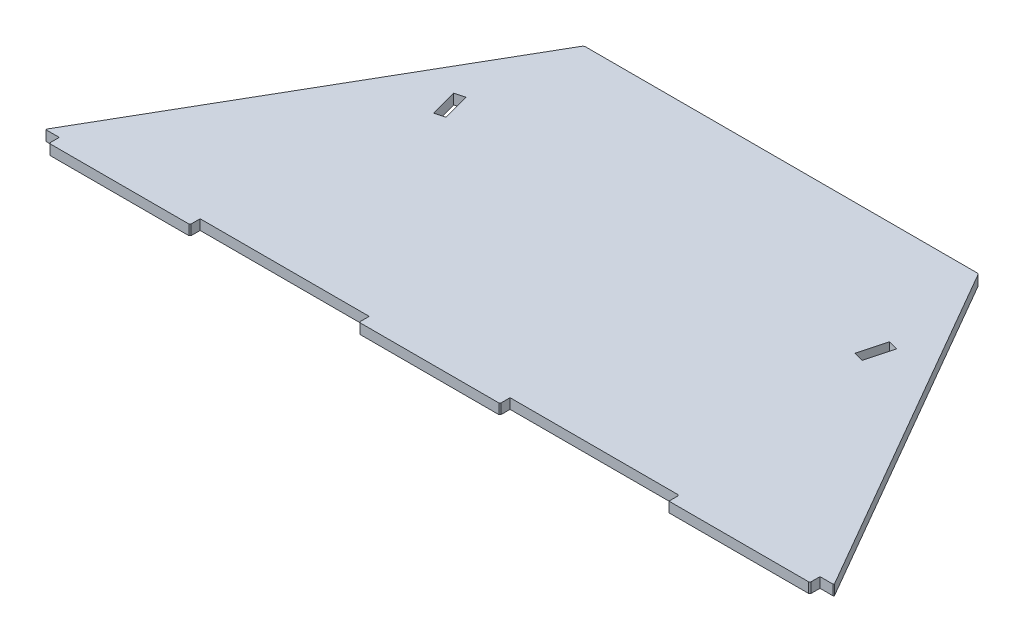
ISO-10303-21;
HEADER;
FILE_DESCRIPTION(('STEP AP214'),'2;1');
FILE_NAME('part.step','',(''),(''),'','','');
FILE_SCHEMA(('AUTOMOTIVE_DESIGN { 1 0 10303 214 1 1 1 1 }'));
ENDSEC;
DATA;
#1=APPLICATION_CONTEXT('core data for automotive mechanical design processes');
#2=APPLICATION_PROTOCOL_DEFINITION('international standard','automotive_design',2000,#1);
#3=PRODUCT_CONTEXT('',#1,'mechanical');
#4=PRODUCT('Part','Part','',(#3));
#5=PRODUCT_RELATED_PRODUCT_CATEGORY('part','',(#4));
#6=PRODUCT_DEFINITION_FORMATION('','',#4);
#7=PRODUCT_DEFINITION_CONTEXT('part definition',#1,'design');
#8=PRODUCT_DEFINITION('design','',#6,#7);
#9=PRODUCT_DEFINITION_SHAPE('','',#8);
#10=(LENGTH_UNIT() NAMED_UNIT(*) SI_UNIT(.MILLI.,.METRE.));
#11=(NAMED_UNIT(*) PLANE_ANGLE_UNIT() SI_UNIT($,.RADIAN.));
#12=(NAMED_UNIT(*) SI_UNIT($,.STERADIAN.) SOLID_ANGLE_UNIT());
#13=UNCERTAINTY_MEASURE_WITH_UNIT(LENGTH_MEASURE(1.E-05),#10,'distance_accuracy_value','');
#14=(GEOMETRIC_REPRESENTATION_CONTEXT(3) GLOBAL_UNCERTAINTY_ASSIGNED_CONTEXT((#13)) GLOBAL_UNIT_ASSIGNED_CONTEXT((#10,
#11,#12)) REPRESENTATION_CONTEXT('',''));
#15=CARTESIAN_POINT('',(0.,0.,0.));
#16=DIRECTION('',(0.,0.,1.));
#17=DIRECTION('',(1.,0.,0.));
#18=AXIS2_PLACEMENT_3D('',#15,#16,#17);
#19=CARTESIAN_POINT('',(-700.,0.,0.));
#20=DIRECTION('',(0.,0.,-1.));
#21=DIRECTION('',(-1.,0.,0.));
#22=AXIS2_PLACEMENT_3D('',#19,#20,#21);
#23=PLANE('',#22);
#24=DIRECTION('',(-1.,0.,0.));
#25=VECTOR('',#24,1.);
#26=CARTESIAN_POINT('',(-700.,0.,0.));
#27=LINE('',#26,#25);
#28=CARTESIAN_POINT('',(423.,0.,0.));
#29=VERTEX_POINT('',#28);
#30=CARTESIAN_POINT('',(125.,0.,0.));
#31=VERTEX_POINT('',#30);
#32=EDGE_CURVE('E395',#29,#31,#27,.T.);
#33=ORIENTED_EDGE('',*,*,#32,.F.);
#34=DIRECTION('',(0.,1.,0.));
#35=VECTOR('',#34,1.);
#36=CARTESIAN_POINT('',(423.,0.,0.));
#37=LINE('',#36,#35);
#38=CARTESIAN_POINT('',(423.,18.,0.));
#39=VERTEX_POINT('',#38);
#40=EDGE_CURVE('E477',#29,#39,#37,.T.);
#41=ORIENTED_EDGE('',*,*,#40,.T.);
#42=DIRECTION('',(-1.,0.,0.));
#43=VECTOR('',#42,1.);
#44=CARTESIAN_POINT('',(-700.,18.,0.));
#45=LINE('',#44,#43);
#46=CARTESIAN_POINT('',(125.,18.,0.));
#47=VERTEX_POINT('',#46);
#48=EDGE_CURVE('E401',#39,#47,#45,.T.);
#49=ORIENTED_EDGE('',*,*,#48,.T.);
#50=DIRECTION('',(0.,1.,0.));
#51=VECTOR('',#50,1.);
#52=CARTESIAN_POINT('',(125.,0.,0.));
#53=LINE('',#52,#51);
#54=EDGE_CURVE('E359',#31,#47,#53,.T.);
#55=ORIENTED_EDGE('',*,*,#54,.F.);
#56=EDGE_LOOP('',(#33,#41,#49,#55));
#57=FACE_BOUND('',#56,.T.);
#58=ADVANCED_FACE('F35',(#57),#23,.F.);
#59=CARTESIAN_POINT('',(-125.,0.,0.));
#60=VERTEX_POINT('',#59);
#61=CARTESIAN_POINT('',(-425.,0.,0.));
#62=VERTEX_POINT('',#61);
#63=EDGE_CURVE('E399',#60,#62,#27,.T.);
#64=ORIENTED_EDGE('',*,*,#63,.F.);
#65=DIRECTION('',(0.,1.,0.));
#66=VECTOR('',#65,1.);
#67=CARTESIAN_POINT('',(-125.,0.,0.));
#68=LINE('',#67,#66);
#69=CARTESIAN_POINT('',(-125.,18.,0.));
#70=VERTEX_POINT('',#69);
#71=EDGE_CURVE('E367',#60,#70,#68,.T.);
#72=ORIENTED_EDGE('',*,*,#71,.T.);
#73=CARTESIAN_POINT('',(-425.,18.,0.));
#74=VERTEX_POINT('',#73);
#75=EDGE_CURVE('E404',#70,#74,#45,.T.);
#76=ORIENTED_EDGE('',*,*,#75,.T.);
#77=DIRECTION('',(0.,1.,0.));
#78=VECTOR('',#77,1.);
#79=CARTESIAN_POINT('',(-425.,0.,0.));
#80=LINE('',#79,#78);
#81=EDGE_CURVE('E382',#62,#74,#80,.T.);
#82=ORIENTED_EDGE('',*,*,#81,.F.);
#83=EDGE_LOOP('',(#64,#72,#76,#82));
#84=FACE_BOUND('',#83,.T.);
#85=ADVANCED_FACE('F555',(#84),#23,.F.);
#86=CARTESIAN_POINT('',(698.,0.,0.));
#87=VERTEX_POINT('',#86);
#88=CARTESIAN_POINT('',(675.,0.,0.));
#89=VERTEX_POINT('',#88);
#90=EDGE_CURVE('E398',#87,#89,#27,.T.);
#91=ORIENTED_EDGE('',*,*,#90,.F.);
#92=DIRECTION('',(0.,1.,0.));
#93=VECTOR('',#92,1.);
#94=CARTESIAN_POINT('',(698.,0.,0.));
#95=LINE('',#94,#93);
#96=CARTESIAN_POINT('',(698.,18.,0.));
#97=VERTEX_POINT('',#96);
#98=EDGE_CURVE('E458',#87,#97,#95,.T.);
#99=ORIENTED_EDGE('',*,*,#98,.T.);
#100=CARTESIAN_POINT('',(675.,18.,0.));
#101=VERTEX_POINT('',#100);
#102=EDGE_CURVE('E403',#97,#101,#45,.T.);
#103=ORIENTED_EDGE('',*,*,#102,.T.);
#104=DIRECTION('',(0.,1.,0.));
#105=VECTOR('',#104,1.);
#106=CARTESIAN_POINT('',(675.,0.,0.));
#107=LINE('',#106,#105);
#108=EDGE_CURVE('E344',#89,#101,#107,.T.);
#109=ORIENTED_EDGE('',*,*,#108,.F.);
#110=EDGE_LOOP('',(#91,#99,#103,#109));
#111=FACE_BOUND('',#110,.T.);
#112=ADVANCED_FACE('F605',(#111),#23,.F.);
#113=CARTESIAN_POINT('',(700.,18.,0.));
#114=DIRECTION('',(-0.866025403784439,0.,0.5));
#115=DIRECTION('',(0.5,0.,0.866025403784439));
#116=AXIS2_PLACEMENT_3D('',#113,#114,#115);
#117=PLANE('',#116);
#118=DIRECTION('',(-0.5,0.,-0.866025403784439));
#119=VECTOR('',#118,1.);
#120=CARTESIAN_POINT('',(700.,18.,0.));
#121=LINE('',#120,#119);
#122=CARTESIAN_POINT('',(699.267949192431,18.,-1.26794919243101));
#123=VERTEX_POINT('',#122);
#124=CARTESIAN_POINT('',(351.443375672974,18.,-603.717782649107));
#125=VERTEX_POINT('',#124);
#126=EDGE_CURVE('E405',#123,#125,#121,.T.);
#127=ORIENTED_EDGE('',*,*,#126,.F.);
#128=DIRECTION('',(0.,-1.,0.));
#129=VECTOR('',#128,1.);
#130=CARTESIAN_POINT('',(699.267949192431,18.,-1.26794919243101));
#131=LINE('',#130,#129);
#132=CARTESIAN_POINT('',(699.267949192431,0.,-1.26794919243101));
#133=VERTEX_POINT('',#132);
#134=EDGE_CURVE('E441',#123,#133,#131,.T.);
#135=ORIENTED_EDGE('',*,*,#134,.T.);
#136=DIRECTION('',(-0.5,0.,-0.866025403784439));
#137=VECTOR('',#136,1.);
#138=CARTESIAN_POINT('',(700.,0.,0.));
#139=LINE('',#138,#137);
#140=CARTESIAN_POINT('',(351.443375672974,0.,-603.717782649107));
#141=VERTEX_POINT('',#140);
#142=EDGE_CURVE('E415',#133,#141,#139,.T.);
#143=ORIENTED_EDGE('',*,*,#142,.T.);
#144=DIRECTION('',(0.,-1.,0.));
#145=VECTOR('',#144,1.);
#146=CARTESIAN_POINT('',(351.443375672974,18.,-603.717782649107));
#147=LINE('',#146,#145);
#148=EDGE_CURVE('E431',#141,#125,#147,.F.);
#149=ORIENTED_EDGE('',*,*,#148,.T.);
#150=EDGE_LOOP('',(#127,#135,#143,#149));
#151=FACE_BOUND('',#150,.T.);
#152=ADVANCED_FACE('F616',(#151),#117,.F.);
#153=CARTESIAN_POINT('',(350.,18.,-606.217782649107));
#154=DIRECTION('',(0.,0.,1.));
#155=DIRECTION('',(1.,0.,0.));
#156=AXIS2_PLACEMENT_3D('',#153,#154,#155);
#157=PLANE('',#156);
#158=DIRECTION('',(-1.,0.,0.));
#159=VECTOR('',#158,1.);
#160=CARTESIAN_POINT('',(350.,18.,-606.217782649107));
#161=LINE('',#160,#159);
#162=CARTESIAN_POINT('',(347.113248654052,18.,-606.217782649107));
#163=VERTEX_POINT('',#162);
#164=CARTESIAN_POINT('',(-347.113248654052,18.,-606.217782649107));
#165=VERTEX_POINT('',#164);
#166=EDGE_CURVE('E407',#163,#165,#161,.T.);
#167=ORIENTED_EDGE('',*,*,#166,.F.);
#168=DIRECTION('',(0.,-1.,0.));
#169=VECTOR('',#168,1.);
#170=CARTESIAN_POINT('',(347.113248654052,18.,-606.217782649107));
#171=LINE('',#170,#169);
#172=CARTESIAN_POINT('',(347.113248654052,0.,-606.217782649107));
#173=VERTEX_POINT('',#172);
#174=EDGE_CURVE('E423',#163,#173,#171,.T.);
#175=ORIENTED_EDGE('',*,*,#174,.T.);
#176=DIRECTION('',(-1.,0.,0.));
#177=VECTOR('',#176,1.);
#178=CARTESIAN_POINT('',(350.,0.,-606.217782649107));
#179=LINE('',#178,#177);
#180=CARTESIAN_POINT('',(-347.113248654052,0.,-606.217782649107));
#181=VERTEX_POINT('',#180);
#182=EDGE_CURVE('E417',#173,#181,#179,.T.);
#183=ORIENTED_EDGE('',*,*,#182,.T.);
#184=DIRECTION('',(0.,-1.,0.));
#185=VECTOR('',#184,1.);
#186=CARTESIAN_POINT('',(-347.113248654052,18.,-606.217782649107));
#187=LINE('',#186,#185);
#188=EDGE_CURVE('E414',#181,#165,#187,.F.);
#189=ORIENTED_EDGE('',*,*,#188,.T.);
#190=EDGE_LOOP('',(#167,#175,#183,#189));
#191=FACE_BOUND('',#190,.T.);
#192=ADVANCED_FACE('F620',(#191),#157,.F.);
#193=CARTESIAN_POINT('',(-350.,18.,-606.217782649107));
#194=DIRECTION('',(0.866025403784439,0.,0.5));
#195=DIRECTION('',(0.5,0.,-0.866025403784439));
#196=AXIS2_PLACEMENT_3D('',#193,#194,#195);
#197=PLANE('',#196);
#198=DIRECTION('',(-0.5,0.,0.866025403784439));
#199=VECTOR('',#198,1.);
#200=CARTESIAN_POINT('',(-350.,0.,-606.217782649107));
#201=LINE('',#200,#199);
#202=CARTESIAN_POINT('',(-351.443375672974,0.,-603.717782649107));
#203=VERTEX_POINT('',#202);
#204=CARTESIAN_POINT('',(-699.,0.,-1.732050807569));
#205=VERTEX_POINT('',#204);
#206=EDGE_CURVE('E408',#203,#205,#201,.T.);
#207=ORIENTED_EDGE('',*,*,#206,.T.);
#208=DIRECTION('',(0.,1.,0.));
#209=VECTOR('',#208,1.);
#210=CARTESIAN_POINT('',(-699.,18.,-1.732050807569));
#211=LINE('',#210,#209);
#212=CARTESIAN_POINT('',(-699.,18.,-1.732050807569));
#213=VERTEX_POINT('',#212);
#214=EDGE_CURVE('E495',#205,#213,#211,.T.);
#215=ORIENTED_EDGE('',*,*,#214,.T.);
#216=DIRECTION('',(-0.5,0.,0.866025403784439));
#217=VECTOR('',#216,1.);
#218=CARTESIAN_POINT('',(-350.,18.,-606.217782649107));
#219=LINE('',#218,#217);
#220=CARTESIAN_POINT('',(-351.443375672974,18.,-603.717782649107));
#221=VERTEX_POINT('',#220);
#222=EDGE_CURVE('E411',#221,#213,#219,.T.);
#223=ORIENTED_EDGE('',*,*,#222,.F.);
#224=DIRECTION('',(0.,-1.,0.));
#225=VECTOR('',#224,1.);
#226=CARTESIAN_POINT('',(-351.443375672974,18.,-603.717782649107));
#227=LINE('',#226,#225);
#228=EDGE_CURVE('E438',#221,#203,#227,.T.);
#229=ORIENTED_EDGE('',*,*,#228,.T.);
#230=EDGE_LOOP('',(#207,#215,#223,#229));
#231=FACE_BOUND('',#230,.T.);
#232=ADVANCED_FACE('F589',(#231),#197,.F.);
#233=CARTESIAN_POINT('',(0.,18.,0.));
#234=DIRECTION('',(0.,1.,0.));
#235=DIRECTION('',(0.,0.,1.));
#236=AXIS2_PLACEMENT_3D('',#233,#234,#235);
#237=PLANE('',#236);
#238=DIRECTION('',(0.258819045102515,0.,0.96592582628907));
#239=VECTOR('',#238,1.);
#240=CARTESIAN_POINT('',(-362.663007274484,18.,-374.229430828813));
#241=LINE('',#240,#239);
#242=CARTESIAN_POINT('',(-375.60395952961,18.,-422.525722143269));
#243=VERTEX_POINT('',#242);
#244=CARTESIAN_POINT('',(-362.663007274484,18.,-374.229430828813));
#245=VERTEX_POINT('',#244);
#246=EDGE_CURVE('E259',#243,#245,#241,.T.);
#247=ORIENTED_EDGE('',*,*,#246,.T.);
#248=DIRECTION('',(-0.965925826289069,0.,0.258819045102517));
#249=VECTOR('',#248,1.);
#250=CARTESIAN_POINT('',(-380.049672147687,18.,-369.570688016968));
#251=LINE('',#250,#249);
#252=CARTESIAN_POINT('',(-380.049672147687,18.,-369.570688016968));
#253=VERTEX_POINT('',#252);
#254=EDGE_CURVE('E271',#245,#253,#251,.T.);
#255=ORIENTED_EDGE('',*,*,#254,.T.);
#256=DIRECTION('',(-0.258819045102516,0.,-0.96592582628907));
#257=VECTOR('',#256,1.);
#258=CARTESIAN_POINT('',(-392.990624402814,18.,-417.866979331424));
#259=LINE('',#258,#257);
#260=CARTESIAN_POINT('',(-392.990624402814,18.,-417.866979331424));
#261=VERTEX_POINT('',#260);
#262=EDGE_CURVE('E275',#253,#261,#259,.T.);
#263=ORIENTED_EDGE('',*,*,#262,.T.);
#264=DIRECTION('',(0.96592582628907,0.,-0.258819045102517));
#265=VECTOR('',#264,1.);
#266=CARTESIAN_POINT('',(-375.60395952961,18.,-422.525722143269));
#267=LINE('',#266,#265);
#268=EDGE_CURVE('E267',#261,#243,#267,.T.);
#269=ORIENTED_EDGE('',*,*,#268,.T.);
#270=EDGE_LOOP('',(#247,#255,#263,#269));
#271=FACE_BOUND('',#270,.T.);
#272=DIRECTION('',(-0.965925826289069,0.,-0.258819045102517));
#273=VECTOR('',#272,1.);
#274=CARTESIAN_POINT('',(380.049672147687,18.,-369.570688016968));
#275=LINE('',#274,#273);
#276=CARTESIAN_POINT('',(380.049672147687,18.,-369.570688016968));
#277=VERTEX_POINT('',#276);
#278=CARTESIAN_POINT('',(362.663007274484,18.,-374.229430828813));
#279=VERTEX_POINT('',#278);
#280=EDGE_CURVE('E300',#277,#279,#275,.T.);
#281=ORIENTED_EDGE('',*,*,#280,.T.);
#282=DIRECTION('',(0.258819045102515,0.,-0.96592582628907));
#283=VECTOR('',#282,1.);
#284=CARTESIAN_POINT('',(362.663007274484,18.,-374.229430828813));
#285=LINE('',#284,#283);
#286=CARTESIAN_POINT('',(375.603959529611,18.,-422.525722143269));
#287=VERTEX_POINT('',#286);
#288=EDGE_CURVE('E303',#279,#287,#285,.T.);
#289=ORIENTED_EDGE('',*,*,#288,.T.);
#290=DIRECTION('',(0.96592582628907,0.,0.258819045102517));
#291=VECTOR('',#290,1.);
#292=CARTESIAN_POINT('',(375.603959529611,18.,-422.525722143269));
#293=LINE('',#292,#291);
#294=CARTESIAN_POINT('',(392.990624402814,18.,-417.866979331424));
#295=VERTEX_POINT('',#294);
#296=EDGE_CURVE('E307',#287,#295,#293,.T.);
#297=ORIENTED_EDGE('',*,*,#296,.T.);
#298=DIRECTION('',(-0.258819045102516,0.,0.96592582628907));
#299=VECTOR('',#298,1.);
#300=CARTESIAN_POINT('',(392.990624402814,18.,-417.866979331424));
#301=LINE('',#300,#299);
#302=EDGE_CURVE('E310',#295,#277,#301,.T.);
#303=ORIENTED_EDGE('',*,*,#302,.T.);
#304=EDGE_LOOP('',(#281,#289,#297,#303));
#305=FACE_BOUND('',#304,.T.);
#306=ORIENTED_EDGE('',*,*,#102,.F.);
#307=DIRECTION('',(-0.707106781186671,0.,0.707106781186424));
#308=VECTOR('',#307,1.);
#309=CARTESIAN_POINT('',(348.999999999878,18.,349.));
#310=LINE('',#309,#308);
#311=EDGE_CURVE('E471',#97,#123,#310,.F.);
#312=ORIENTED_EDGE('',*,*,#311,.T.);
#313=ORIENTED_EDGE('',*,*,#126,.T.);
#314=CARTESIAN_POINT('',(347.113248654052,18.,-601.217782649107));
#315=DIRECTION('',(0.,1.,0.));
#316=DIRECTION('',(0.,0.,1.));
#317=AXIS2_PLACEMENT_3D('',#314,#315,#316);
#318=CIRCLE('',#317,5.);
#319=EDGE_CURVE('E436',#125,#163,#318,.T.);
#320=ORIENTED_EDGE('',*,*,#319,.T.);
#321=ORIENTED_EDGE('',*,*,#166,.T.);
#322=CARTESIAN_POINT('',(-347.113248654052,18.,-601.217782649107));
#323=DIRECTION('',(0.,1.,0.));
#324=DIRECTION('',(0.,0.,1.));
#325=AXIS2_PLACEMENT_3D('',#322,#323,#324);
#326=CIRCLE('',#325,5.);
#327=EDGE_CURVE('E434',#165,#221,#326,.T.);
#328=ORIENTED_EDGE('',*,*,#327,.T.);
#329=ORIENTED_EDGE('',*,*,#222,.T.);
#330=DIRECTION('',(-0.258819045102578,0.,-0.965925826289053));
#331=VECTOR('',#330,1.);
#332=CARTESIAN_POINT('',(-651.742865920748,18.,174.633974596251));
#333=LINE('',#332,#331);
#334=CARTESIAN_POINT('',(-698.535898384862,18.,0.));
#335=VERTEX_POINT('',#334);
#336=EDGE_CURVE('E464',#213,#335,#333,.F.);
#337=ORIENTED_EDGE('',*,*,#336,.T.);
#338=CARTESIAN_POINT('',(-675.,18.,0.));
#339=VERTEX_POINT('',#338);
#340=EDGE_CURVE('E392',#339,#335,#45,.T.);
#341=ORIENTED_EDGE('',*,*,#340,.F.);
#342=DIRECTION('',(0.,0.,1.));
#343=VECTOR('',#342,1.);
#344=CARTESIAN_POINT('',(-675.,18.,0.));
#345=LINE('',#344,#343);
#346=CARTESIAN_POINT('',(-675.,18.,16.0000000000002));
#347=VERTEX_POINT('',#346);
#348=EDGE_CURVE('E370',#339,#347,#345,.T.);
#349=ORIENTED_EDGE('',*,*,#348,.T.);
#350=DIRECTION('',(-0.707106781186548,0.,-0.707106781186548));
#351=VECTOR('',#350,1.);
#352=CARTESIAN_POINT('',(-345.5,18.,345.5));
#353=LINE('',#352,#351);
#354=CARTESIAN_POINT('',(-673.,18.,18.0000000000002));
#355=VERTEX_POINT('',#354);
#356=EDGE_CURVE('E460',#347,#355,#353,.F.);
#357=ORIENTED_EDGE('',*,*,#356,.T.);
#358=DIRECTION('',(1.,0.,0.));
#359=VECTOR('',#358,1.);
#360=CARTESIAN_POINT('',(-675.,18.,18.0000000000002));
#361=LINE('',#360,#359);
#362=CARTESIAN_POINT('',(-427.,18.,18.0000000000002));
#363=VERTEX_POINT('',#362);
#364=EDGE_CURVE('E385',#355,#363,#361,.T.);
#365=ORIENTED_EDGE('',*,*,#364,.T.);
#366=DIRECTION('',(-0.707106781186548,0.,0.707106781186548));
#367=VECTOR('',#366,1.);
#368=CARTESIAN_POINT('',(-204.5,18.,-204.5));
#369=LINE('',#368,#367);
#370=CARTESIAN_POINT('',(-425.,18.,16.0000000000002));
#371=VERTEX_POINT('',#370);
#372=EDGE_CURVE('E462',#363,#371,#369,.F.);
#373=ORIENTED_EDGE('',*,*,#372,.T.);
#374=DIRECTION('',(0.,0.,-1.));
#375=VECTOR('',#374,1.);
#376=CARTESIAN_POINT('',(-425.,18.,0.));
#377=LINE('',#376,#375);
#378=EDGE_CURVE('E377',#371,#74,#377,.T.);
#379=ORIENTED_EDGE('',*,*,#378,.T.);
#380=ORIENTED_EDGE('',*,*,#75,.F.);
#381=DIRECTION('',(0.,0.,1.));
#382=VECTOR('',#381,1.);
#383=CARTESIAN_POINT('',(-125.,18.,0.));
#384=LINE('',#383,#382);
#385=CARTESIAN_POINT('',(-125.,18.,16.0000000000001));
#386=VERTEX_POINT('',#385);
#387=EDGE_CURVE('E347',#70,#386,#384,.T.);
#388=ORIENTED_EDGE('',*,*,#387,.T.);
#389=DIRECTION('',(-0.707106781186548,0.,-0.707106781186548));
#390=VECTOR('',#389,1.);
#391=CARTESIAN_POINT('',(-70.5,18.,70.5));
#392=LINE('',#391,#390);
#393=CARTESIAN_POINT('',(-123.,18.,18.0000000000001));
#394=VERTEX_POINT('',#393);
#395=EDGE_CURVE('E466',#386,#394,#392,.F.);
#396=ORIENTED_EDGE('',*,*,#395,.T.);
#397=DIRECTION('',(1.,0.,0.));
#398=VECTOR('',#397,1.);
#399=CARTESIAN_POINT('',(-125.,18.,18.0000000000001));
#400=LINE('',#399,#398);
#401=CARTESIAN_POINT('',(123.,18.,18.0000000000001));
#402=VERTEX_POINT('',#401);
#403=EDGE_CURVE('E362',#394,#402,#400,.T.);
#404=ORIENTED_EDGE('',*,*,#403,.T.);
#405=DIRECTION('',(-0.707106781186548,0.,0.707106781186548));
#406=VECTOR('',#405,1.);
#407=CARTESIAN_POINT('',(70.5000000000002,18.,70.5000000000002));
#408=LINE('',#407,#406);
#409=CARTESIAN_POINT('',(125.,18.,16.0000000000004));
#410=VERTEX_POINT('',#409);
#411=EDGE_CURVE('E468',#402,#410,#408,.F.);
#412=ORIENTED_EDGE('',*,*,#411,.T.);
#413=DIRECTION('',(0.,0.,-1.));
#414=VECTOR('',#413,1.);
#415=CARTESIAN_POINT('',(125.,18.,0.));
#416=LINE('',#415,#414);
#417=EDGE_CURVE('E354',#410,#47,#416,.T.);
#418=ORIENTED_EDGE('',*,*,#417,.T.);
#419=ORIENTED_EDGE('',*,*,#48,.F.);
#420=DIRECTION('',(0.707106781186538,0.,0.707106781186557));
#421=VECTOR('',#420,1.);
#422=CARTESIAN_POINT('',(423.,18.,0.));
#423=LINE('',#422,#421);
#424=CARTESIAN_POINT('',(425.,18.,1.99999999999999));
#425=VERTEX_POINT('',#424);
#426=EDGE_CURVE('E43',#39,#425,#423,.T.);
#427=ORIENTED_EDGE('',*,*,#426,.T.);
#428=DIRECTION('',(0.,0.,1.));
#429=VECTOR('',#428,1.);
#430=CARTESIAN_POINT('',(425.,18.,0.));
#431=LINE('',#430,#429);
#432=CARTESIAN_POINT('',(425.,18.,18.));
#433=VERTEX_POINT('',#432);
#434=EDGE_CURVE('E296',#425,#433,#431,.T.);
#435=ORIENTED_EDGE('',*,*,#434,.T.);
#436=DIRECTION('',(1.,0.,0.));
#437=VECTOR('',#436,1.);
#438=CARTESIAN_POINT('',(425.,18.,18.));
#439=LINE('',#438,#437);
#440=CARTESIAN_POINT('',(673.,18.,18.));
#441=VERTEX_POINT('',#440);
#442=EDGE_CURVE('E341',#433,#441,#439,.T.);
#443=ORIENTED_EDGE('',*,*,#442,.T.);
#444=DIRECTION('',(-0.707106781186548,0.,0.707106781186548));
#445=VECTOR('',#444,1.);
#446=CARTESIAN_POINT('',(345.5,18.,345.5));
#447=LINE('',#446,#445);
#448=CARTESIAN_POINT('',(675.,18.,16.));
#449=VERTEX_POINT('',#448);
#450=EDGE_CURVE('E50',#441,#449,#447,.F.);
#451=ORIENTED_EDGE('',*,*,#450,.T.);
#452=DIRECTION('',(0.,0.,-1.));
#453=VECTOR('',#452,1.);
#454=CARTESIAN_POINT('',(675.,18.,0.));
#455=LINE('',#454,#453);
#456=EDGE_CURVE('E334',#449,#101,#455,.T.);
#457=ORIENTED_EDGE('',*,*,#456,.T.);
#458=EDGE_LOOP('',(#306,#312,#313,#320,#321,#328,#329,#337,#341,#349,#357,#365,#373,#379,#380,
#388,#396,#404,#412,#418,#419,#427,#435,#443,#451,#457));
#459=FACE_BOUND('',#458,.T.);
#460=ADVANCED_FACE('F277',(#271,#305,#459),#237,.T.);
#461=CARTESIAN_POINT('',(0.,0.,0.));
#462=DIRECTION('',(0.,1.,0.));
#463=DIRECTION('',(0.,0.,1.));
#464=AXIS2_PLACEMENT_3D('',#461,#462,#463);
#465=PLANE('',#464);
#466=DIRECTION('',(-0.965925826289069,0.,0.258819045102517));
#467=VECTOR('',#466,1.);
#468=CARTESIAN_POINT('',(-380.049672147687,0.,-369.570688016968));
#469=LINE('',#468,#467);
#470=CARTESIAN_POINT('',(-362.663007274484,0.,-374.229430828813));
#471=VERTEX_POINT('',#470);
#472=CARTESIAN_POINT('',(-380.049672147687,0.,-369.570688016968));
#473=VERTEX_POINT('',#472);
#474=EDGE_CURVE('E289',#471,#473,#469,.T.);
#475=ORIENTED_EDGE('',*,*,#474,.F.);
#476=DIRECTION('',(0.258819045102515,0.,0.96592582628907));
#477=VECTOR('',#476,1.);
#478=CARTESIAN_POINT('',(-362.663007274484,0.,-374.229430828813));
#479=LINE('',#478,#477);
#480=CARTESIAN_POINT('',(-375.60395952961,0.,-422.525722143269));
#481=VERTEX_POINT('',#480);
#482=EDGE_CURVE('E262',#481,#471,#479,.T.);
#483=ORIENTED_EDGE('',*,*,#482,.F.);
#484=DIRECTION('',(0.96592582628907,0.,-0.258819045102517));
#485=VECTOR('',#484,1.);
#486=CARTESIAN_POINT('',(-375.60395952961,0.,-422.525722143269));
#487=LINE('',#486,#485);
#488=CARTESIAN_POINT('',(-392.990624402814,0.,-417.866979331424));
#489=VERTEX_POINT('',#488);
#490=EDGE_CURVE('E280',#489,#481,#487,.T.);
#491=ORIENTED_EDGE('',*,*,#490,.F.);
#492=DIRECTION('',(-0.258819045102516,0.,-0.96592582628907));
#493=VECTOR('',#492,1.);
#494=CARTESIAN_POINT('',(-392.990624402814,0.,-417.866979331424));
#495=LINE('',#494,#493);
#496=EDGE_CURVE('E283',#473,#489,#495,.T.);
#497=ORIENTED_EDGE('',*,*,#496,.F.);
#498=EDGE_LOOP('',(#475,#483,#491,#497));
#499=FACE_BOUND('',#498,.T.);
#500=DIRECTION('',(0.258819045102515,0.,-0.96592582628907));
#501=VECTOR('',#500,1.);
#502=CARTESIAN_POINT('',(362.663007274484,0.,-374.229430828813));
#503=LINE('',#502,#501);
#504=CARTESIAN_POINT('',(362.663007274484,0.,-374.229430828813));
#505=VERTEX_POINT('',#504);
#506=CARTESIAN_POINT('',(375.603959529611,0.,-422.525722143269));
#507=VERTEX_POINT('',#506);
#508=EDGE_CURVE('E316',#505,#507,#503,.T.);
#509=ORIENTED_EDGE('',*,*,#508,.F.);
#510=DIRECTION('',(-0.965925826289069,0.,-0.258819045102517));
#511=VECTOR('',#510,1.);
#512=CARTESIAN_POINT('',(380.049672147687,0.,-369.570688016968));
#513=LINE('',#512,#511);
#514=CARTESIAN_POINT('',(380.049672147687,0.,-369.570688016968));
#515=VERTEX_POINT('',#514);
#516=EDGE_CURVE('E314',#515,#505,#513,.T.);
#517=ORIENTED_EDGE('',*,*,#516,.F.);
#518=DIRECTION('',(-0.258819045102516,0.,0.96592582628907));
#519=VECTOR('',#518,1.);
#520=CARTESIAN_POINT('',(392.990624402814,0.,-417.866979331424));
#521=LINE('',#520,#519);
#522=CARTESIAN_POINT('',(392.990624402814,0.,-417.866979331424));
#523=VERTEX_POINT('',#522);
#524=EDGE_CURVE('E304',#523,#515,#521,.T.);
#525=ORIENTED_EDGE('',*,*,#524,.F.);
#526=DIRECTION('',(0.96592582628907,0.,0.258819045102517));
#527=VECTOR('',#526,1.);
#528=CARTESIAN_POINT('',(375.603959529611,0.,-422.525722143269));
#529=LINE('',#528,#527);
#530=EDGE_CURVE('E319',#507,#523,#529,.T.);
#531=ORIENTED_EDGE('',*,*,#530,.F.);
#532=EDGE_LOOP('',(#509,#517,#525,#531));
#533=FACE_BOUND('',#532,.T.);
#534=ORIENTED_EDGE('',*,*,#142,.F.);
#535=DIRECTION('',(0.707106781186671,0.,-0.707106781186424));
#536=VECTOR('',#535,1.);
#537=CARTESIAN_POINT('',(699.267949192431,0.,-1.26794919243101));
#538=LINE('',#537,#536);
#539=EDGE_CURVE('E456',#133,#87,#538,.F.);
#540=ORIENTED_EDGE('',*,*,#539,.T.);
#541=ORIENTED_EDGE('',*,*,#90,.T.);
#542=DIRECTION('',(0.,0.,-1.));
#543=VECTOR('',#542,1.);
#544=CARTESIAN_POINT('',(675.,0.,0.));
#545=LINE('',#544,#543);
#546=CARTESIAN_POINT('',(675.,0.,16.));
#547=VERTEX_POINT('',#546);
#548=EDGE_CURVE('E337',#547,#89,#545,.T.);
#549=ORIENTED_EDGE('',*,*,#548,.F.);
#550=DIRECTION('',(0.707106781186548,0.,-0.707106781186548));
#551=VECTOR('',#550,1.);
#552=CARTESIAN_POINT('',(673.,0.,18.));
#553=LINE('',#552,#551);
#554=CARTESIAN_POINT('',(673.,0.,18.));
#555=VERTEX_POINT('',#554);
#556=EDGE_CURVE('E454',#547,#555,#553,.F.);
#557=ORIENTED_EDGE('',*,*,#556,.T.);
#558=DIRECTION('',(1.,0.,0.));
#559=VECTOR('',#558,1.);
#560=CARTESIAN_POINT('',(425.,0.,18.));
#561=LINE('',#560,#559);
#562=CARTESIAN_POINT('',(425.,0.,18.));
#563=VERTEX_POINT('',#562);
#564=EDGE_CURVE('E333',#563,#555,#561,.T.);
#565=ORIENTED_EDGE('',*,*,#564,.F.);
#566=DIRECTION('',(0.,0.,1.));
#567=VECTOR('',#566,1.);
#568=CARTESIAN_POINT('',(425.,0.,0.));
#569=LINE('',#568,#567);
#570=CARTESIAN_POINT('',(425.,0.,1.99999999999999));
#571=VERTEX_POINT('',#570);
#572=EDGE_CURVE('E331',#571,#563,#569,.T.);
#573=ORIENTED_EDGE('',*,*,#572,.F.);
#574=DIRECTION('',(-0.707106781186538,0.,-0.707106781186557));
#575=VECTOR('',#574,1.);
#576=CARTESIAN_POINT('',(211.500000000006,0.,-211.5));
#577=LINE('',#576,#575);
#578=EDGE_CURVE('E11',#571,#29,#577,.T.);
#579=ORIENTED_EDGE('',*,*,#578,.T.);
#580=ORIENTED_EDGE('',*,*,#32,.T.);
#581=DIRECTION('',(0.,0.,-1.));
#582=VECTOR('',#581,1.);
#583=CARTESIAN_POINT('',(125.,0.,0.));
#584=LINE('',#583,#582);
#585=CARTESIAN_POINT('',(125.,0.,16.0000000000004));
#586=VERTEX_POINT('',#585);
#587=EDGE_CURVE('E357',#586,#31,#584,.T.);
#588=ORIENTED_EDGE('',*,*,#587,.F.);
#589=DIRECTION('',(0.707106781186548,0.,-0.707106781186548));
#590=VECTOR('',#589,1.);
#591=CARTESIAN_POINT('',(123.,0.,18.0000000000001));
#592=LINE('',#591,#590);
#593=CARTESIAN_POINT('',(123.,0.,18.0000000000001));
#594=VERTEX_POINT('',#593);
#595=EDGE_CURVE('E452',#586,#594,#592,.F.);
#596=ORIENTED_EDGE('',*,*,#595,.T.);
#597=DIRECTION('',(1.,0.,0.));
#598=VECTOR('',#597,1.);
#599=CARTESIAN_POINT('',(-125.,0.,18.0000000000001));
#600=LINE('',#599,#598);
#601=CARTESIAN_POINT('',(-123.,0.,18.0000000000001));
#602=VERTEX_POINT('',#601);
#603=EDGE_CURVE('E353',#602,#594,#600,.T.);
#604=ORIENTED_EDGE('',*,*,#603,.F.);
#605=DIRECTION('',(0.707106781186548,0.,0.707106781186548));
#606=VECTOR('',#605,1.);
#607=CARTESIAN_POINT('',(-125.,0.,16.0000000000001));
#608=LINE('',#607,#606);
#609=CARTESIAN_POINT('',(-125.,0.,16.0000000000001));
#610=VERTEX_POINT('',#609);
#611=EDGE_CURVE('E450',#602,#610,#608,.F.);
#612=ORIENTED_EDGE('',*,*,#611,.T.);
#613=DIRECTION('',(0.,0.,1.));
#614=VECTOR('',#613,1.);
#615=CARTESIAN_POINT('',(-125.,0.,0.));
#616=LINE('',#615,#614);
#617=EDGE_CURVE('E350',#60,#610,#616,.T.);
#618=ORIENTED_EDGE('',*,*,#617,.F.);
#619=ORIENTED_EDGE('',*,*,#63,.T.);
#620=DIRECTION('',(0.,0.,-1.));
#621=VECTOR('',#620,1.);
#622=CARTESIAN_POINT('',(-425.,0.,0.));
#623=LINE('',#622,#621);
#624=CARTESIAN_POINT('',(-425.,0.,16.0000000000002));
#625=VERTEX_POINT('',#624);
#626=EDGE_CURVE('E380',#625,#62,#623,.T.);
#627=ORIENTED_EDGE('',*,*,#626,.F.);
#628=DIRECTION('',(0.707106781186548,0.,-0.707106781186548));
#629=VECTOR('',#628,1.);
#630=CARTESIAN_POINT('',(-427.,0.,18.0000000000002));
#631=LINE('',#630,#629);
#632=CARTESIAN_POINT('',(-427.,0.,18.0000000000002));
#633=VERTEX_POINT('',#632);
#634=EDGE_CURVE('E446',#625,#633,#631,.F.);
#635=ORIENTED_EDGE('',*,*,#634,.T.);
#636=DIRECTION('',(1.,0.,0.));
#637=VECTOR('',#636,1.);
#638=CARTESIAN_POINT('',(-675.,0.,18.0000000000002));
#639=LINE('',#638,#637);
#640=CARTESIAN_POINT('',(-673.,0.,18.0000000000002));
#641=VERTEX_POINT('',#640);
#642=EDGE_CURVE('E376',#641,#633,#639,.T.);
#643=ORIENTED_EDGE('',*,*,#642,.F.);
#644=DIRECTION('',(0.707106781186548,0.,0.707106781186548));
#645=VECTOR('',#644,1.);
#646=CARTESIAN_POINT('',(-675.,0.,16.0000000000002));
#647=LINE('',#646,#645);
#648=CARTESIAN_POINT('',(-675.,0.,16.0000000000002));
#649=VERTEX_POINT('',#648);
#650=EDGE_CURVE('E444',#641,#649,#647,.F.);
#651=ORIENTED_EDGE('',*,*,#650,.T.);
#652=DIRECTION('',(0.,0.,1.));
#653=VECTOR('',#652,1.);
#654=CARTESIAN_POINT('',(-675.,0.,0.));
#655=LINE('',#654,#653);
#656=CARTESIAN_POINT('',(-675.,0.,0.));
#657=VERTEX_POINT('',#656);
#658=EDGE_CURVE('E373',#657,#649,#655,.T.);
#659=ORIENTED_EDGE('',*,*,#658,.F.);
#660=CARTESIAN_POINT('',(-698.535898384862,0.,0.));
#661=VERTEX_POINT('',#660);
#662=EDGE_CURVE('E400',#657,#661,#27,.T.);
#663=ORIENTED_EDGE('',*,*,#662,.T.);
#664=DIRECTION('',(0.258819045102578,0.,0.965925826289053));
#665=VECTOR('',#664,1.);
#666=CARTESIAN_POINT('',(-698.535898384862,0.,0.));
#667=LINE('',#666,#665);
#668=EDGE_CURVE('E448',#661,#205,#667,.F.);
#669=ORIENTED_EDGE('',*,*,#668,.T.);
#670=ORIENTED_EDGE('',*,*,#206,.F.);
#671=CARTESIAN_POINT('',(-347.113248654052,0.,-601.217782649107));
#672=DIRECTION('',(0.,1.,0.));
#673=DIRECTION('',(0.,0.,1.));
#674=AXIS2_PLACEMENT_3D('',#671,#672,#673);
#675=CIRCLE('',#674,5.);
#676=EDGE_CURVE('E426',#203,#181,#675,.F.);
#677=ORIENTED_EDGE('',*,*,#676,.T.);
#678=ORIENTED_EDGE('',*,*,#182,.F.);
#679=CARTESIAN_POINT('',(347.113248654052,0.,-601.217782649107));
#680=DIRECTION('',(0.,1.,0.));
#681=DIRECTION('',(0.,0.,1.));
#682=AXIS2_PLACEMENT_3D('',#679,#680,#681);
#683=CIRCLE('',#682,5.);
#684=EDGE_CURVE('E428',#173,#141,#683,.F.);
#685=ORIENTED_EDGE('',*,*,#684,.T.);
#686=EDGE_LOOP('',(#534,#540,#541,#549,#557,#565,#573,#579,#580,#588,#596,#604,#612,#618,#619,
#627,#635,#643,#651,#659,#663,#669,#670,#677,#678,#685));
#687=FACE_BOUND('',#686,.T.);
#688=ADVANCED_FACE('F522',(#499,#533,#687),#465,.F.);
#689=ORIENTED_EDGE('',*,*,#340,.T.);
#690=DIRECTION('',(0.,-1.,0.));
#691=VECTOR('',#690,1.);
#692=CARTESIAN_POINT('',(-698.535898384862,0.,0.));
#693=LINE('',#692,#691);
#694=EDGE_CURVE('E492',#335,#661,#693,.T.);
#695=ORIENTED_EDGE('',*,*,#694,.T.);
#696=ORIENTED_EDGE('',*,*,#662,.F.);
#697=DIRECTION('',(0.,1.,0.));
#698=VECTOR('',#697,1.);
#699=CARTESIAN_POINT('',(-675.,0.,0.));
#700=LINE('',#699,#698);
#701=EDGE_CURVE('E389',#657,#339,#700,.T.);
#702=ORIENTED_EDGE('',*,*,#701,.T.);
#703=EDGE_LOOP('',(#689,#695,#696,#702));
#704=FACE_BOUND('',#703,.T.);
#705=ADVANCED_FACE('F579',(#704),#23,.F.);
#706=CARTESIAN_POINT('',(-675.,0.,0.));
#707=DIRECTION('',(-1.,0.,0.));
#708=DIRECTION('',(0.,0.,1.));
#709=AXIS2_PLACEMENT_3D('',#706,#707,#708);
#710=PLANE('',#709);
#711=ORIENTED_EDGE('',*,*,#658,.T.);
#712=DIRECTION('',(0.,1.,0.));
#713=VECTOR('',#712,1.);
#714=CARTESIAN_POINT('',(-675.,0.,16.0000000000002));
#715=LINE('',#714,#713);
#716=EDGE_CURVE('E504',#649,#347,#715,.T.);
#717=ORIENTED_EDGE('',*,*,#716,.T.);
#718=ORIENTED_EDGE('',*,*,#348,.F.);
#719=ORIENTED_EDGE('',*,*,#701,.F.);
#720=EDGE_LOOP('',(#711,#717,#718,#719));
#721=FACE_BOUND('',#720,.T.);
#722=ADVANCED_FACE('F575',(#721),#710,.T.);
#723=CARTESIAN_POINT('',(-425.,0.,0.));
#724=DIRECTION('',(1.,0.,0.));
#725=DIRECTION('',(0.,0.,-1.));
#726=AXIS2_PLACEMENT_3D('',#723,#724,#725);
#727=PLANE('',#726);
#728=ORIENTED_EDGE('',*,*,#378,.F.);
#729=DIRECTION('',(0.,-1.,0.));
#730=VECTOR('',#729,1.);
#731=CARTESIAN_POINT('',(-425.,0.,16.0000000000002));
#732=LINE('',#731,#730);
#733=EDGE_CURVE('E502',#371,#625,#732,.T.);
#734=ORIENTED_EDGE('',*,*,#733,.T.);
#735=ORIENTED_EDGE('',*,*,#626,.T.);
#736=ORIENTED_EDGE('',*,*,#81,.T.);
#737=EDGE_LOOP('',(#728,#734,#735,#736));
#738=FACE_BOUND('',#737,.T.);
#739=ADVANCED_FACE('F558',(#738),#727,.T.);
#740=CARTESIAN_POINT('',(-675.,0.,18.0000000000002));
#741=DIRECTION('',(0.,0.,1.));
#742=DIRECTION('',(1.,0.,0.));
#743=AXIS2_PLACEMENT_3D('',#740,#741,#742);
#744=PLANE('',#743);
#745=ORIENTED_EDGE('',*,*,#642,.T.);
#746=DIRECTION('',(0.,1.,0.));
#747=VECTOR('',#746,1.);
#748=CARTESIAN_POINT('',(-427.,0.,18.0000000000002));
#749=LINE('',#748,#747);
#750=EDGE_CURVE('E499',#633,#363,#749,.T.);
#751=ORIENTED_EDGE('',*,*,#750,.T.);
#752=ORIENTED_EDGE('',*,*,#364,.F.);
#753=DIRECTION('',(0.,-1.,0.));
#754=VECTOR('',#753,1.);
#755=CARTESIAN_POINT('',(-673.,0.,18.0000000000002));
#756=LINE('',#755,#754);
#757=EDGE_CURVE('E497',#355,#641,#756,.T.);
#758=ORIENTED_EDGE('',*,*,#757,.T.);
#759=EDGE_LOOP('',(#745,#751,#752,#758));
#760=FACE_BOUND('',#759,.T.);
#761=ADVANCED_FACE('F566',(#760),#744,.T.);
#762=CARTESIAN_POINT('',(-125.,0.,0.));
#763=DIRECTION('',(-1.,0.,0.));
#764=DIRECTION('',(0.,0.,1.));
#765=AXIS2_PLACEMENT_3D('',#762,#763,#764);
#766=PLANE('',#765);
#767=ORIENTED_EDGE('',*,*,#617,.T.);
#768=DIRECTION('',(0.,1.,0.));
#769=VECTOR('',#768,1.);
#770=CARTESIAN_POINT('',(-125.,0.,16.0000000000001));
#771=LINE('',#770,#769);
#772=EDGE_CURVE('E489',#610,#386,#771,.T.);
#773=ORIENTED_EDGE('',*,*,#772,.T.);
#774=ORIENTED_EDGE('',*,*,#387,.F.);
#775=ORIENTED_EDGE('',*,*,#71,.F.);
#776=EDGE_LOOP('',(#767,#773,#774,#775));
#777=FACE_BOUND('',#776,.T.);
#778=ADVANCED_FACE('F546',(#777),#766,.T.);
#779=CARTESIAN_POINT('',(125.,0.,0.));
#780=DIRECTION('',(1.,0.,0.));
#781=DIRECTION('',(0.,0.,-1.));
#782=AXIS2_PLACEMENT_3D('',#779,#780,#781);
#783=PLANE('',#782);
#784=ORIENTED_EDGE('',*,*,#417,.F.);
#785=DIRECTION('',(0.,-1.,0.));
#786=VECTOR('',#785,1.);
#787=CARTESIAN_POINT('',(125.,0.,16.0000000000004));
#788=LINE('',#787,#786);
#789=EDGE_CURVE('E487',#410,#586,#788,.T.);
#790=ORIENTED_EDGE('',*,*,#789,.T.);
#791=ORIENTED_EDGE('',*,*,#587,.T.);
#792=ORIENTED_EDGE('',*,*,#54,.T.);
#793=EDGE_LOOP('',(#784,#790,#791,#792));
#794=FACE_BOUND('',#793,.T.);
#795=ADVANCED_FACE('F529',(#794),#783,.T.);
#796=CARTESIAN_POINT('',(-125.,0.,18.0000000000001));
#797=DIRECTION('',(0.,0.,1.));
#798=DIRECTION('',(1.,0.,0.));
#799=AXIS2_PLACEMENT_3D('',#796,#797,#798);
#800=PLANE('',#799);
#801=ORIENTED_EDGE('',*,*,#603,.T.);
#802=DIRECTION('',(0.,1.,0.));
#803=VECTOR('',#802,1.);
#804=CARTESIAN_POINT('',(123.,0.,18.0000000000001));
#805=LINE('',#804,#803);
#806=EDGE_CURVE('E484',#594,#402,#805,.T.);
#807=ORIENTED_EDGE('',*,*,#806,.T.);
#808=ORIENTED_EDGE('',*,*,#403,.F.);
#809=DIRECTION('',(0.,-1.,0.));
#810=VECTOR('',#809,1.);
#811=CARTESIAN_POINT('',(-123.,0.,18.0000000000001));
#812=LINE('',#811,#810);
#813=EDGE_CURVE('E482',#394,#602,#812,.T.);
#814=ORIENTED_EDGE('',*,*,#813,.T.);
#815=EDGE_LOOP('',(#801,#807,#808,#814));
#816=FACE_BOUND('',#815,.T.);
#817=ADVANCED_FACE('F538',(#816),#800,.T.);
#818=CARTESIAN_POINT('',(425.,0.,0.));
#819=DIRECTION('',(-1.,0.,0.));
#820=DIRECTION('',(0.,0.,1.));
#821=AXIS2_PLACEMENT_3D('',#818,#819,#820);
#822=PLANE('',#821);
#823=ORIENTED_EDGE('',*,*,#434,.F.);
#824=DIRECTION('',(0.,-1.,0.));
#825=VECTOR('',#824,1.);
#826=CARTESIAN_POINT('',(425.,0.,1.99999999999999));
#827=LINE('',#826,#825);
#828=EDGE_CURVE('E480',#425,#571,#827,.T.);
#829=ORIENTED_EDGE('',*,*,#828,.T.);
#830=ORIENTED_EDGE('',*,*,#572,.T.);
#831=DIRECTION('',(0.,1.,0.));
#832=VECTOR('',#831,1.);
#833=CARTESIAN_POINT('',(425.,0.,18.));
#834=LINE('',#833,#832);
#835=EDGE_CURVE('E339',#563,#433,#834,.T.);
#836=ORIENTED_EDGE('',*,*,#835,.T.);
#837=EDGE_LOOP('',(#823,#829,#830,#836));
#838=FACE_BOUND('',#837,.T.);
#839=ADVANCED_FACE('F513',(#838),#822,.T.);
#840=CARTESIAN_POINT('',(675.,0.,0.));
#841=DIRECTION('',(1.,0.,0.));
#842=DIRECTION('',(0.,0.,-1.));
#843=AXIS2_PLACEMENT_3D('',#840,#841,#842);
#844=PLANE('',#843);
#845=ORIENTED_EDGE('',*,*,#456,.F.);
#846=DIRECTION('',(0.,-1.,0.));
#847=VECTOR('',#846,1.);
#848=CARTESIAN_POINT('',(675.,0.,16.));
#849=LINE('',#848,#847);
#850=EDGE_CURVE('E475',#449,#547,#849,.T.);
#851=ORIENTED_EDGE('',*,*,#850,.T.);
#852=ORIENTED_EDGE('',*,*,#548,.T.);
#853=ORIENTED_EDGE('',*,*,#108,.T.);
#854=EDGE_LOOP('',(#845,#851,#852,#853));
#855=FACE_BOUND('',#854,.T.);
#856=ADVANCED_FACE('F790',(#855),#844,.T.);
#857=CARTESIAN_POINT('',(425.,0.,18.));
#858=DIRECTION('',(0.,0.,1.));
#859=DIRECTION('',(1.,0.,0.));
#860=AXIS2_PLACEMENT_3D('',#857,#858,#859);
#861=PLANE('',#860);
#862=ORIENTED_EDGE('',*,*,#564,.T.);
#863=DIRECTION('',(0.,1.,0.));
#864=VECTOR('',#863,1.);
#865=CARTESIAN_POINT('',(673.,0.,18.));
#866=LINE('',#865,#864);
#867=EDGE_CURVE('E473',#555,#441,#866,.T.);
#868=ORIENTED_EDGE('',*,*,#867,.T.);
#869=ORIENTED_EDGE('',*,*,#442,.F.);
#870=ORIENTED_EDGE('',*,*,#835,.F.);
#871=EDGE_LOOP('',(#862,#868,#869,#870));
#872=FACE_BOUND('',#871,.T.);
#873=ADVANCED_FACE('F781',(#872),#861,.T.);
#874=CARTESIAN_POINT('',(380.049672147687,18.,-369.570688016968));
#875=DIRECTION('',(-0.258819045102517,0.,0.965925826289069));
#876=DIRECTION('',(0.965925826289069,0.,0.258819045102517));
#877=AXIS2_PLACEMENT_3D('',#874,#875,#876);
#878=PLANE('',#877);
#879=ORIENTED_EDGE('',*,*,#516,.T.);
#880=DIRECTION('',(0.,-1.,0.));
#881=VECTOR('',#880,1.);
#882=CARTESIAN_POINT('',(362.663007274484,18.,-374.229430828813));
#883=LINE('',#882,#881);
#884=EDGE_CURVE('E313',#279,#505,#883,.T.);
#885=ORIENTED_EDGE('',*,*,#884,.F.);
#886=ORIENTED_EDGE('',*,*,#280,.F.);
#887=DIRECTION('',(0.,-1.,0.));
#888=VECTOR('',#887,1.);
#889=CARTESIAN_POINT('',(380.049672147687,18.,-369.570688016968));
#890=LINE('',#889,#888);
#891=EDGE_CURVE('E290',#277,#515,#890,.T.);
#892=ORIENTED_EDGE('',*,*,#891,.T.);
#893=EDGE_LOOP('',(#879,#885,#886,#892));
#894=FACE_BOUND('',#893,.T.);
#895=ADVANCED_FACE('F772',(#894),#878,.F.);
#896=CARTESIAN_POINT('',(392.990624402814,18.,-417.866979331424));
#897=DIRECTION('',(0.96592582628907,0.,0.258819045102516));
#898=DIRECTION('',(0.258819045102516,0.,-0.96592582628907));
#899=AXIS2_PLACEMENT_3D('',#896,#897,#898);
#900=PLANE('',#899);
#901=ORIENTED_EDGE('',*,*,#524,.T.);
#902=ORIENTED_EDGE('',*,*,#891,.F.);
#903=ORIENTED_EDGE('',*,*,#302,.F.);
#904=DIRECTION('',(0.,-1.,0.));
#905=VECTOR('',#904,1.);
#906=CARTESIAN_POINT('',(392.990624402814,18.,-417.866979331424));
#907=LINE('',#906,#905);
#908=EDGE_CURVE('E325',#295,#523,#907,.T.);
#909=ORIENTED_EDGE('',*,*,#908,.T.);
#910=EDGE_LOOP('',(#901,#902,#903,#909));
#911=FACE_BOUND('',#910,.T.);
#912=ADVANCED_FACE('F763',(#911),#900,.F.);
#913=CARTESIAN_POINT('',(375.603959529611,18.,-422.525722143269));
#914=DIRECTION('',(0.258819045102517,0.,-0.965925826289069));
#915=DIRECTION('',(-0.965925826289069,0.,-0.258819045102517));
#916=AXIS2_PLACEMENT_3D('',#913,#914,#915);
#917=PLANE('',#916);
#918=ORIENTED_EDGE('',*,*,#530,.T.);
#919=ORIENTED_EDGE('',*,*,#908,.F.);
#920=ORIENTED_EDGE('',*,*,#296,.F.);
#921=DIRECTION('',(0.,-1.,0.));
#922=VECTOR('',#921,1.);
#923=CARTESIAN_POINT('',(375.603959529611,18.,-422.525722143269));
#924=LINE('',#923,#922);
#925=EDGE_CURVE('E327',#287,#507,#924,.T.);
#926=ORIENTED_EDGE('',*,*,#925,.T.);
#927=EDGE_LOOP('',(#918,#919,#920,#926));
#928=FACE_BOUND('',#927,.T.);
#929=ADVANCED_FACE('F754',(#928),#917,.F.);
#930=CARTESIAN_POINT('',(362.663007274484,18.,-374.229430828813));
#931=DIRECTION('',(-0.96592582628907,0.,-0.258819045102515));
#932=DIRECTION('',(-0.258819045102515,0.,0.96592582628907));
#933=AXIS2_PLACEMENT_3D('',#930,#931,#932);
#934=PLANE('',#933);
#935=ORIENTED_EDGE('',*,*,#508,.T.);
#936=ORIENTED_EDGE('',*,*,#925,.F.);
#937=ORIENTED_EDGE('',*,*,#288,.F.);
#938=ORIENTED_EDGE('',*,*,#884,.T.);
#939=EDGE_LOOP('',(#935,#936,#937,#938));
#940=FACE_BOUND('',#939,.T.);
#941=ADVANCED_FACE('F746',(#940),#934,.F.);
#942=CARTESIAN_POINT('',(-362.663007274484,18.,-374.229430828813));
#943=DIRECTION('',(0.96592582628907,0.,-0.258819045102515));
#944=DIRECTION('',(-0.258819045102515,0.,-0.96592582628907));
#945=AXIS2_PLACEMENT_3D('',#942,#943,#944);
#946=PLANE('',#945);
#947=ORIENTED_EDGE('',*,*,#482,.T.);
#948=DIRECTION('',(0.,-1.,0.));
#949=VECTOR('',#948,1.);
#950=CARTESIAN_POINT('',(-362.663007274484,18.,-374.229430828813));
#951=LINE('',#950,#949);
#952=EDGE_CURVE('E255',#245,#471,#951,.T.);
#953=ORIENTED_EDGE('',*,*,#952,.F.);
#954=ORIENTED_EDGE('',*,*,#246,.F.);
#955=DIRECTION('',(0.,-1.,0.));
#956=VECTOR('',#955,1.);
#957=CARTESIAN_POINT('',(-375.60395952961,18.,-422.525722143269));
#958=LINE('',#957,#956);
#959=EDGE_CURVE('E294',#243,#481,#958,.T.);
#960=ORIENTED_EDGE('',*,*,#959,.T.);
#961=EDGE_LOOP('',(#947,#953,#954,#960));
#962=FACE_BOUND('',#961,.T.);
#963=ADVANCED_FACE('F257',(#962),#946,.F.);
#964=CARTESIAN_POINT('',(-375.60395952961,18.,-422.525722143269));
#965=DIRECTION('',(-0.258819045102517,0.,-0.965925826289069));
#966=DIRECTION('',(-0.965925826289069,0.,0.258819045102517));
#967=AXIS2_PLACEMENT_3D('',#964,#965,#966);
#968=PLANE('',#967);
#969=ORIENTED_EDGE('',*,*,#490,.T.);
#970=ORIENTED_EDGE('',*,*,#959,.F.);
#971=ORIENTED_EDGE('',*,*,#268,.F.);
#972=DIRECTION('',(0.,-1.,0.));
#973=VECTOR('',#972,1.);
#974=CARTESIAN_POINT('',(-392.990624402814,18.,-417.866979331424));
#975=LINE('',#974,#973);
#976=EDGE_CURVE('E297',#261,#489,#975,.T.);
#977=ORIENTED_EDGE('',*,*,#976,.T.);
#978=EDGE_LOOP('',(#969,#970,#971,#977));
#979=FACE_BOUND('',#978,.T.);
#980=ADVANCED_FACE('F729',(#979),#968,.F.);
#981=CARTESIAN_POINT('',(-392.990624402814,18.,-417.866979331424));
#982=DIRECTION('',(-0.96592582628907,0.,0.258819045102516));
#983=DIRECTION('',(0.258819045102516,0.,0.96592582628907));
#984=AXIS2_PLACEMENT_3D('',#981,#982,#983);
#985=PLANE('',#984);
#986=ORIENTED_EDGE('',*,*,#496,.T.);
#987=ORIENTED_EDGE('',*,*,#976,.F.);
#988=ORIENTED_EDGE('',*,*,#262,.F.);
#989=DIRECTION('',(0.,-1.,0.));
#990=VECTOR('',#989,1.);
#991=CARTESIAN_POINT('',(-380.049672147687,18.,-369.570688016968));
#992=LINE('',#991,#990);
#993=EDGE_CURVE('E266',#253,#473,#992,.T.);
#994=ORIENTED_EDGE('',*,*,#993,.T.);
#995=EDGE_LOOP('',(#986,#987,#988,#994));
#996=FACE_BOUND('',#995,.T.);
#997=ADVANCED_FACE('F721',(#996),#985,.F.);
#998=CARTESIAN_POINT('',(-380.049672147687,18.,-369.570688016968));
#999=DIRECTION('',(0.258819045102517,0.,0.965925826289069));
#1000=DIRECTION('',(0.965925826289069,0.,-0.258819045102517));
#1001=AXIS2_PLACEMENT_3D('',#998,#999,#1000);
#1002=PLANE('',#1001);
#1003=ORIENTED_EDGE('',*,*,#474,.T.);
#1004=ORIENTED_EDGE('',*,*,#993,.F.);
#1005=ORIENTED_EDGE('',*,*,#254,.F.);
#1006=ORIENTED_EDGE('',*,*,#952,.T.);
#1007=EDGE_LOOP('',(#1003,#1004,#1005,#1006));
#1008=FACE_BOUND('',#1007,.T.);
#1009=ADVANCED_FACE('F272',(#1008),#1002,.F.);
#1010=CARTESIAN_POINT('',(347.113248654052,18.,-601.217782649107));
#1011=DIRECTION('',(0.,-1.,0.));
#1012=DIRECTION('',(0.,0.,-1.));
#1013=AXIS2_PLACEMENT_3D('',#1010,#1011,#1012);
#1014=CYLINDRICAL_SURFACE('',#1013,5.);
#1015=ORIENTED_EDGE('',*,*,#319,.F.);
#1016=ORIENTED_EDGE('',*,*,#148,.F.);
#1017=ORIENTED_EDGE('',*,*,#684,.F.);
#1018=ORIENTED_EDGE('',*,*,#174,.F.);
#1019=EDGE_LOOP('',(#1015,#1016,#1017,#1018));
#1020=FACE_BOUND('',#1019,.T.);
#1021=ADVANCED_FACE('F636',(#1020),#1014,.T.);
#1022=CARTESIAN_POINT('',(-347.113248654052,18.,-601.217782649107));
#1023=DIRECTION('',(0.,-1.,0.));
#1024=DIRECTION('',(0.,0.,-1.));
#1025=AXIS2_PLACEMENT_3D('',#1022,#1023,#1024);
#1026=CYLINDRICAL_SURFACE('',#1025,5.);
#1027=ORIENTED_EDGE('',*,*,#327,.F.);
#1028=ORIENTED_EDGE('',*,*,#188,.F.);
#1029=ORIENTED_EDGE('',*,*,#676,.F.);
#1030=ORIENTED_EDGE('',*,*,#228,.F.);
#1031=EDGE_LOOP('',(#1027,#1028,#1029,#1030));
#1032=FACE_BOUND('',#1031,.T.);
#1033=ADVANCED_FACE('F643',(#1032),#1026,.T.);
#1034=CARTESIAN_POINT('',(699.267949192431,18.,-1.26794919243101));
#1035=DIRECTION('',(-0.707106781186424,0.,-0.707106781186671));
#1036=DIRECTION('',(0.,-1.,0.));
#1037=AXIS2_PLACEMENT_3D('',#1034,#1035,#1036);
#1038=PLANE('',#1037);
#1039=ORIENTED_EDGE('',*,*,#311,.F.);
#1040=ORIENTED_EDGE('',*,*,#98,.F.);
#1041=ORIENTED_EDGE('',*,*,#539,.F.);
#1042=ORIENTED_EDGE('',*,*,#134,.F.);
#1043=EDGE_LOOP('',(#1039,#1040,#1041,#1042));
#1044=FACE_BOUND('',#1043,.T.);
#1045=ADVANCED_FACE('F629',(#1044),#1038,.F.);
#1046=CARTESIAN_POINT('',(673.,0.,18.));
#1047=DIRECTION('',(-0.707106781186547,0.,-0.707106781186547));
#1048=DIRECTION('',(0.,1.,0.));
#1049=AXIS2_PLACEMENT_3D('',#1046,#1047,#1048);
#1050=PLANE('',#1049);
#1051=ORIENTED_EDGE('',*,*,#556,.F.);
#1052=ORIENTED_EDGE('',*,*,#850,.F.);
#1053=ORIENTED_EDGE('',*,*,#450,.F.);
#1054=ORIENTED_EDGE('',*,*,#867,.F.);
#1055=EDGE_LOOP('',(#1051,#1052,#1053,#1054));
#1056=FACE_BOUND('',#1055,.T.);
#1057=ADVANCED_FACE('F650',(#1056),#1050,.F.);
#1058=CARTESIAN_POINT('',(423.,0.,0.));
#1059=DIRECTION('',(0.707106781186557,0.,-0.707106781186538));
#1060=DIRECTION('',(0.,1.,0.));
#1061=AXIS2_PLACEMENT_3D('',#1058,#1059,#1060);
#1062=PLANE('',#1061);
#1063=ORIENTED_EDGE('',*,*,#578,.F.);
#1064=ORIENTED_EDGE('',*,*,#828,.F.);
#1065=ORIENTED_EDGE('',*,*,#426,.F.);
#1066=ORIENTED_EDGE('',*,*,#40,.F.);
#1067=EDGE_LOOP('',(#1063,#1064,#1065,#1066));
#1068=FACE_BOUND('',#1067,.T.);
#1069=ADVANCED_FACE('F518',(#1068),#1062,.F.);
#1070=CARTESIAN_POINT('',(123.,0.,18.0000000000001));
#1071=DIRECTION('',(-0.707106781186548,0.,-0.707106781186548));
#1072=DIRECTION('',(0.,1.,0.));
#1073=AXIS2_PLACEMENT_3D('',#1070,#1071,#1072);
#1074=PLANE('',#1073);
#1075=ORIENTED_EDGE('',*,*,#595,.F.);
#1076=ORIENTED_EDGE('',*,*,#789,.F.);
#1077=ORIENTED_EDGE('',*,*,#411,.F.);
#1078=ORIENTED_EDGE('',*,*,#806,.F.);
#1079=EDGE_LOOP('',(#1075,#1076,#1077,#1078));
#1080=FACE_BOUND('',#1079,.T.);
#1081=ADVANCED_FACE('F535',(#1080),#1074,.F.);
#1082=CARTESIAN_POINT('',(-125.,0.,16.0000000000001));
#1083=DIRECTION('',(0.707106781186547,0.,-0.707106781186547));
#1084=DIRECTION('',(0.,1.,0.));
#1085=AXIS2_PLACEMENT_3D('',#1082,#1083,#1084);
#1086=PLANE('',#1085);
#1087=ORIENTED_EDGE('',*,*,#611,.F.);
#1088=ORIENTED_EDGE('',*,*,#813,.F.);
#1089=ORIENTED_EDGE('',*,*,#395,.F.);
#1090=ORIENTED_EDGE('',*,*,#772,.F.);
#1091=EDGE_LOOP('',(#1087,#1088,#1089,#1090));
#1092=FACE_BOUND('',#1091,.T.);
#1093=ADVANCED_FACE('F544',(#1092),#1086,.F.);
#1094=CARTESIAN_POINT('',(-698.535898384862,0.,0.));
#1095=DIRECTION('',(0.965925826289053,0.,-0.258819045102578));
#1096=DIRECTION('',(0.,-1.,0.));
#1097=AXIS2_PLACEMENT_3D('',#1094,#1095,#1096);
#1098=PLANE('',#1097);
#1099=ORIENTED_EDGE('',*,*,#336,.F.);
#1100=ORIENTED_EDGE('',*,*,#214,.F.);
#1101=ORIENTED_EDGE('',*,*,#668,.F.);
#1102=ORIENTED_EDGE('',*,*,#694,.F.);
#1103=EDGE_LOOP('',(#1099,#1100,#1101,#1102));
#1104=FACE_BOUND('',#1103,.T.);
#1105=ADVANCED_FACE('F592',(#1104),#1098,.F.);
#1106=CARTESIAN_POINT('',(-427.,0.,18.0000000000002));
#1107=DIRECTION('',(-0.707106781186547,0.,-0.707106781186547));
#1108=DIRECTION('',(0.,1.,0.));
#1109=AXIS2_PLACEMENT_3D('',#1106,#1107,#1108);
#1110=PLANE('',#1109);
#1111=ORIENTED_EDGE('',*,*,#634,.F.);
#1112=ORIENTED_EDGE('',*,*,#733,.F.);
#1113=ORIENTED_EDGE('',*,*,#372,.F.);
#1114=ORIENTED_EDGE('',*,*,#750,.F.);
#1115=EDGE_LOOP('',(#1111,#1112,#1113,#1114));
#1116=FACE_BOUND('',#1115,.T.);
#1117=ADVANCED_FACE('F561',(#1116),#1110,.F.);
#1118=CARTESIAN_POINT('',(-675.,0.,16.0000000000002));
#1119=DIRECTION('',(0.707106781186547,0.,-0.707106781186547));
#1120=DIRECTION('',(0.,1.,0.));
#1121=AXIS2_PLACEMENT_3D('',#1118,#1119,#1120);
#1122=PLANE('',#1121);
#1123=ORIENTED_EDGE('',*,*,#650,.F.);
#1124=ORIENTED_EDGE('',*,*,#757,.F.);
#1125=ORIENTED_EDGE('',*,*,#356,.F.);
#1126=ORIENTED_EDGE('',*,*,#716,.F.);
#1127=EDGE_LOOP('',(#1123,#1124,#1125,#1126));
#1128=FACE_BOUND('',#1127,.T.);
#1129=ADVANCED_FACE('F37',(#1128),#1122,.F.);
#1130=CLOSED_SHELL('',(#58,#85,#112,#152,#192,#232,#460,#688,#705,#722,#739,#761,#778,#795,#817,
#839,#856,#873,#895,#912,#929,#941,#963,#980,#997,#1009,#1021,#1033,#1045,#1057,#1069,#1081,
#1093,#1105,#1117,#1129));
#1131=MANIFOLD_SOLID_BREP('B2',#1130);
#1132=ADVANCED_BREP_SHAPE_REPRESENTATION('',(#18,#1131),#14);
#1133=SHAPE_DEFINITION_REPRESENTATION(#9,#1132);
ENDSEC;
END-ISO-10303-21;
